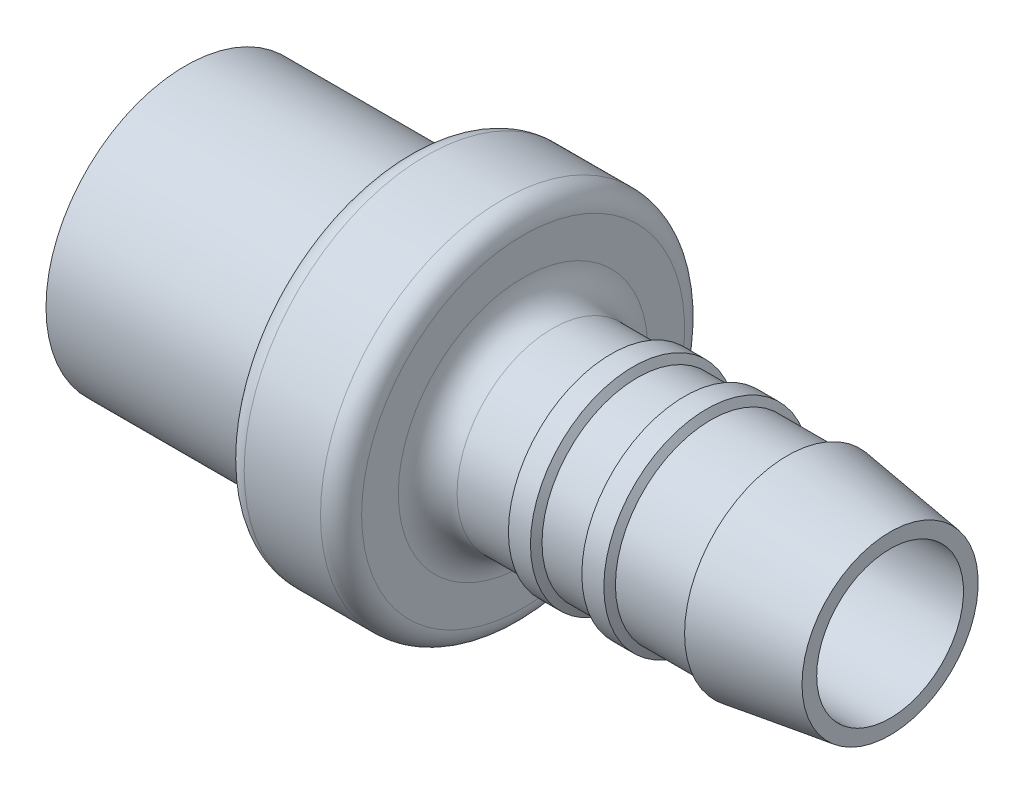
from build123d import *

# Parameters (mm, degrees)
CONG_1_R = 2


with BuildPart() as part:
    # Esquisse1 → R_volution1 (revolve)
    with BuildSketch(Plane.XY, mode=Mode.PRIVATE) as r_volution1_sk:
        with BuildLine():
            Line((0, 9.5), (-15, 9.5))
            Line((-15, 9.5), (-15, 6.5))
            Line((-15, 6.5), (0, 6.5))
            Line((0, 6.5), (1.242310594, 5))
            Line((1.242310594, 5), (33, 5))
            Line((33, 5), (33, 6))
            Line((33, 6), (26, 7))
            Line((26, 7), (26, 6.5))
            Line((26, 6.5), (20.788675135, 6.5))
            Line((20.788675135, 6.5), (20.5, 7))
            Line((20.5, 7), (19, 7))
            Line((19, 7), (19, 6.5))
            Line((19, 6.5), (15.788675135, 6.5))
            Line((15.788675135, 6.5), (15.5, 7))
            Line((15.5, 7), (14, 7))
            Line((14, 7), (14, 6.5))
            Line((14, 6.5), (8, 6.5))
            Line((8, 6.5), (8, 11))
            ThreePointArc((8, 11), (7.589949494, 11.989949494), (6.6, 12.4))
            Line((6.6, 12.4), (1.4, 12.4))
            ThreePointArc((1.4, 12.4), (0.410050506, 11.989949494), (0, 11))
            Line((0, 11), (0, 9.5))
        make_face()
    revolve(r_volution1_sk.sketch.rotate(Axis((-21.39854114, 0, 0), (1, 0, 0)), 90), axis=Axis((-21.39854114, 0, 0), (1, 0, 0)))

    # Cong_1
    cong_1_edges = [part.edges().sort_by_distance(p)[0] for p in [
        (8, 0, -6.5),
    ]]
    fillet(cong_1_edges, radius=CONG_1_R)


solid = part.part
